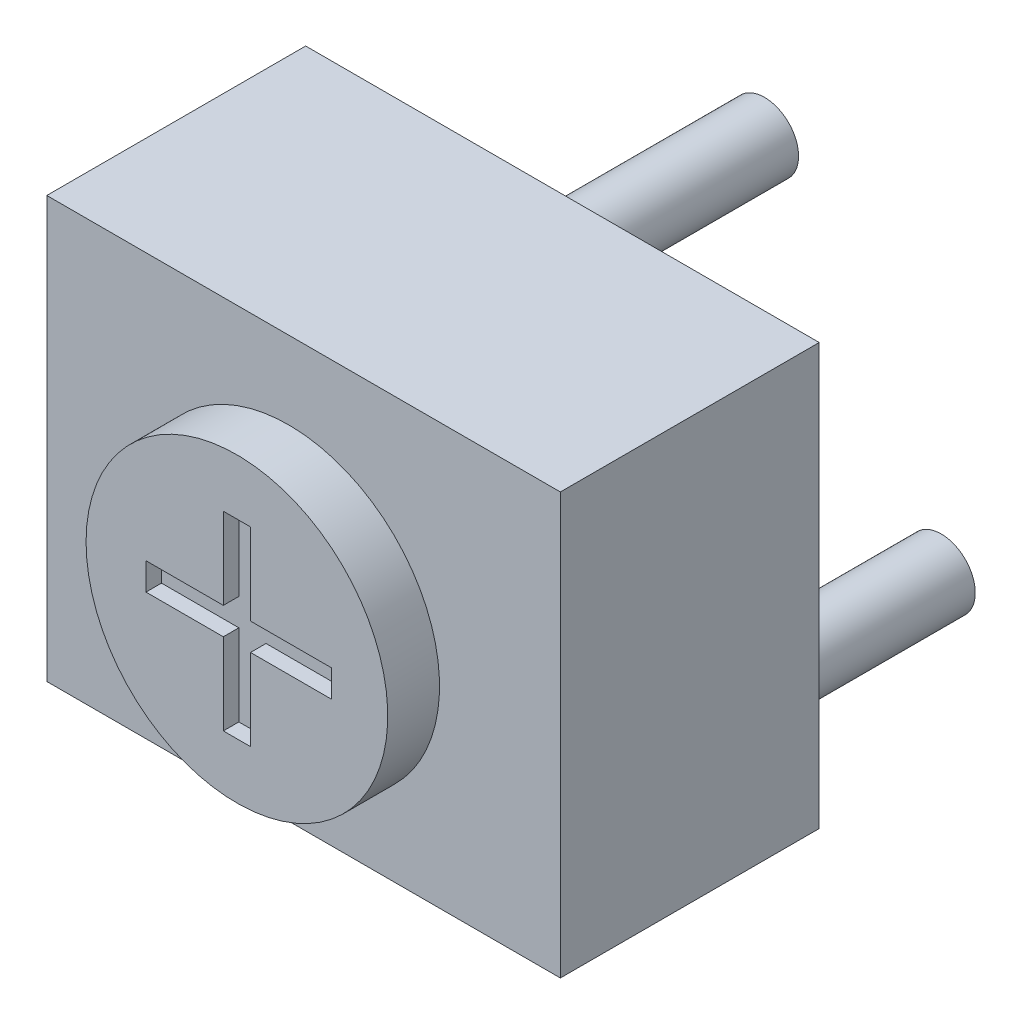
ISO-10303-21;
HEADER;
FILE_DESCRIPTION(('STEP AP214'),'2;1');
FILE_NAME('part.step','',(''),(''),'','','');
FILE_SCHEMA(('AUTOMOTIVE_DESIGN { 1 0 10303 214 1 1 1 1 }'));
ENDSEC;
DATA;
#1=APPLICATION_CONTEXT('core data for automotive mechanical design processes');
#2=APPLICATION_PROTOCOL_DEFINITION('international standard','automotive_design',2000,#1);
#3=PRODUCT_CONTEXT('',#1,'mechanical');
#4=PRODUCT('Part','Part','',(#3));
#5=PRODUCT_RELATED_PRODUCT_CATEGORY('part','',(#4));
#6=PRODUCT_DEFINITION_FORMATION('','',#4);
#7=PRODUCT_DEFINITION_CONTEXT('part definition',#1,'design');
#8=PRODUCT_DEFINITION('design','',#6,#7);
#9=PRODUCT_DEFINITION_SHAPE('','',#8);
#10=(LENGTH_UNIT() NAMED_UNIT(*) SI_UNIT(.MILLI.,.METRE.));
#11=(NAMED_UNIT(*) PLANE_ANGLE_UNIT() SI_UNIT($,.RADIAN.));
#12=(NAMED_UNIT(*) SI_UNIT($,.STERADIAN.) SOLID_ANGLE_UNIT());
#13=UNCERTAINTY_MEASURE_WITH_UNIT(LENGTH_MEASURE(1.E-05),#10,'distance_accuracy_value','');
#14=(GEOMETRIC_REPRESENTATION_CONTEXT(3) GLOBAL_UNCERTAINTY_ASSIGNED_CONTEXT((#13)) GLOBAL_UNIT_ASSIGNED_CONTEXT((#10,
#11,#12)) REPRESENTATION_CONTEXT('',''));
#15=CARTESIAN_POINT('',(0.,0.,0.));
#16=DIRECTION('',(0.,0.,1.));
#17=DIRECTION('',(1.,0.,0.));
#18=AXIS2_PLACEMENT_3D('',#15,#16,#17);
#19=CARTESIAN_POINT('',(40.749645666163,-15.2273275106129,0.));
#20=DIRECTION('',(0.,0.,-1.));
#21=DIRECTION('',(-1.,0.,0.));
#22=AXIS2_PLACEMENT_3D('',#19,#20,#21);
#23=PLANE('',#22);
#24=CARTESIAN_POINT('',(44.6544819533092,-15.8546141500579,0.));
#25=DIRECTION('',(0.,0.,-1.));
#26=DIRECTION('',(-1.,0.,0.));
#27=AXIS2_PLACEMENT_3D('',#24,#25,#26);
#28=CIRCLE('',#27,0.499999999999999);
#29=CARTESIAN_POINT('',(44.1544819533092,-15.8546141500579,0.));
#30=VERTEX_POINT('',#29);
#31=EDGE_CURVE('E256',#30,#30,#28,.F.);
#32=ORIENTED_EDGE('',*,*,#31,.T.);
#33=EDGE_LOOP('',(#32));
#34=FACE_BOUND('',#33,.T.);
#35=DIRECTION('',(0.,-1.,0.));
#36=VECTOR('',#35,1.);
#37=CARTESIAN_POINT('',(40.749645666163,-21.4224598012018,0.));
#38=LINE('',#37,#36);
#39=CARTESIAN_POINT('',(40.749645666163,-15.2273275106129,0.));
#40=VERTEX_POINT('',#39);
#41=CARTESIAN_POINT('',(40.749645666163,-21.4224598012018,0.));
#42=VERTEX_POINT('',#41);
#43=EDGE_CURVE('E271',#40,#42,#38,.T.);
#44=ORIENTED_EDGE('',*,*,#43,.F.);
#45=DIRECTION('',(-1.,0.,0.));
#46=VECTOR('',#45,1.);
#47=CARTESIAN_POINT('',(40.749645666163,-15.2273275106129,0.));
#48=LINE('',#47,#46);
#49=CARTESIAN_POINT('',(48.3081263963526,-15.2273275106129,0.));
#50=VERTEX_POINT('',#49);
#51=EDGE_CURVE('E278',#50,#40,#48,.T.);
#52=ORIENTED_EDGE('',*,*,#51,.F.);
#53=DIRECTION('',(0.,1.,0.));
#54=VECTOR('',#53,1.);
#55=CARTESIAN_POINT('',(48.3081263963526,-21.4224598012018,0.));
#56=LINE('',#55,#54);
#57=CARTESIAN_POINT('',(48.3081263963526,-21.4224598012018,0.));
#58=VERTEX_POINT('',#57);
#59=EDGE_CURVE('E276',#58,#50,#56,.T.);
#60=ORIENTED_EDGE('',*,*,#59,.F.);
#61=DIRECTION('',(1.,0.,0.));
#62=VECTOR('',#61,1.);
#63=CARTESIAN_POINT('',(40.749645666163,-21.4224598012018,0.));
#64=LINE('',#63,#62);
#65=EDGE_CURVE('E274',#42,#58,#64,.T.);
#66=ORIENTED_EDGE('',*,*,#65,.F.);
#67=EDGE_LOOP('',(#44,#52,#60,#66));
#68=FACE_BOUND('',#67,.T.);
#69=CARTESIAN_POINT('',(41.8502779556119,-20.1195169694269,0.));
#70=DIRECTION('',(0.,0.,-1.));
#71=DIRECTION('',(-1.,0.,0.));
#72=AXIS2_PLACEMENT_3D('',#69,#70,#71);
#73=CIRCLE('',#72,0.499999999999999);
#74=CARTESIAN_POINT('',(41.3502779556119,-20.1195169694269,0.));
#75=VERTEX_POINT('',#74);
#76=EDGE_CURVE('E262',#75,#75,#73,.F.);
#77=ORIENTED_EDGE('',*,*,#76,.T.);
#78=EDGE_LOOP('',(#77));
#79=FACE_BOUND('',#78,.T.);
#80=CARTESIAN_POINT('',(47.2545591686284,-20.1195169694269,0.));
#81=DIRECTION('',(0.,0.,-1.));
#82=DIRECTION('',(-1.,0.,0.));
#83=AXIS2_PLACEMENT_3D('',#80,#81,#82);
#84=CIRCLE('',#83,0.499999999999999);
#85=CARTESIAN_POINT('',(46.7545591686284,-20.1195169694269,0.));
#86=VERTEX_POINT('',#85);
#87=EDGE_CURVE('E232',#86,#86,#84,.F.);
#88=ORIENTED_EDGE('',*,*,#87,.T.);
#89=EDGE_LOOP('',(#88));
#90=FACE_BOUND('',#89,.T.);
#91=ADVANCED_FACE('F31',(#34,#68,#79,#90),#23,.T.);
#92=CARTESIAN_POINT('',(40.749645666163,-15.2273275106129,3.81));
#93=DIRECTION('',(0.,0.,-1.));
#94=DIRECTION('',(-1.,0.,0.));
#95=AXIS2_PLACEMENT_3D('',#92,#93,#94);
#96=PLANE('',#95);
#97=DIRECTION('',(0.,-1.,0.));
#98=VECTOR('',#97,1.);
#99=CARTESIAN_POINT('',(40.749645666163,-21.4224598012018,3.81));
#100=LINE('',#99,#98);
#101=CARTESIAN_POINT('',(40.749645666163,-15.2273275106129,3.81));
#102=VERTEX_POINT('',#101);
#103=CARTESIAN_POINT('',(40.749645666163,-21.4224598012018,3.81));
#104=VERTEX_POINT('',#103);
#105=EDGE_CURVE('E280',#102,#104,#100,.T.);
#106=ORIENTED_EDGE('',*,*,#105,.T.);
#107=DIRECTION('',(1.,0.,0.));
#108=VECTOR('',#107,1.);
#109=CARTESIAN_POINT('',(40.749645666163,-21.4224598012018,3.81));
#110=LINE('',#109,#108);
#111=CARTESIAN_POINT('',(48.3081263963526,-21.4224598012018,3.81));
#112=VERTEX_POINT('',#111);
#113=EDGE_CURVE('E282',#104,#112,#110,.T.);
#114=ORIENTED_EDGE('',*,*,#113,.T.);
#115=DIRECTION('',(0.,1.,0.));
#116=VECTOR('',#115,1.);
#117=CARTESIAN_POINT('',(48.3081263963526,-21.4224598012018,3.81));
#118=LINE('',#117,#116);
#119=CARTESIAN_POINT('',(48.3081263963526,-15.2273275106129,3.81));
#120=VERTEX_POINT('',#119);
#121=EDGE_CURVE('E284',#112,#120,#118,.T.);
#122=ORIENTED_EDGE('',*,*,#121,.T.);
#123=DIRECTION('',(-1.,0.,0.));
#124=VECTOR('',#123,1.);
#125=CARTESIAN_POINT('',(40.749645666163,-15.2273275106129,3.81));
#126=LINE('',#125,#124);
#127=EDGE_CURVE('E54',#120,#102,#126,.T.);
#128=ORIENTED_EDGE('',*,*,#127,.T.);
#129=EDGE_LOOP('',(#106,#114,#122,#128));
#130=FACE_BOUND('',#129,.T.);
#131=CARTESIAN_POINT('',(44.3095345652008,-18.5911967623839,3.81));
#132=DIRECTION('',(0.,0.,-1.));
#133=DIRECTION('',(-1.,0.,0.));
#134=AXIS2_PLACEMENT_3D('',#131,#132,#133);
#135=CIRCLE('',#134,2.22008477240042);
#136=CARTESIAN_POINT('',(42.0894497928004,-18.5911967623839,3.81));
#137=VERTEX_POINT('',#136);
#138=EDGE_CURVE('E11',#137,#137,#135,.F.);
#139=ORIENTED_EDGE('',*,*,#138,.F.);
#140=EDGE_LOOP('',(#139));
#141=FACE_BOUND('',#140,.T.);
#142=ADVANCED_FACE('F313',(#130,#141),#96,.F.);
#143=CARTESIAN_POINT('',(40.749645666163,-21.4224598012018,3.81));
#144=DIRECTION('',(1.,0.,0.));
#145=DIRECTION('',(0.,0.,-1.));
#146=AXIS2_PLACEMENT_3D('',#143,#144,#145);
#147=PLANE('',#146);
#148=ORIENTED_EDGE('',*,*,#43,.T.);
#149=DIRECTION('',(0.,0.,-1.));
#150=VECTOR('',#149,1.);
#151=CARTESIAN_POINT('',(40.749645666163,-21.4224598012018,3.81));
#152=LINE('',#151,#150);
#153=EDGE_CURVE('E39',#104,#42,#152,.T.);
#154=ORIENTED_EDGE('',*,*,#153,.F.);
#155=ORIENTED_EDGE('',*,*,#105,.F.);
#156=DIRECTION('',(0.,0.,-1.));
#157=VECTOR('',#156,1.);
#158=CARTESIAN_POINT('',(40.749645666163,-15.2273275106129,3.81));
#159=LINE('',#158,#157);
#160=EDGE_CURVE('E287',#102,#40,#159,.T.);
#161=ORIENTED_EDGE('',*,*,#160,.T.);
#162=EDGE_LOOP('',(#148,#154,#155,#161));
#163=FACE_BOUND('',#162,.T.);
#164=ADVANCED_FACE('F33',(#163),#147,.F.);
#165=CARTESIAN_POINT('',(40.749645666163,-21.4224598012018,3.81));
#166=DIRECTION('',(0.,1.,0.));
#167=DIRECTION('',(0.,0.,1.));
#168=AXIS2_PLACEMENT_3D('',#165,#166,#167);
#169=PLANE('',#168);
#170=ORIENTED_EDGE('',*,*,#65,.T.);
#171=DIRECTION('',(0.,0.,-1.));
#172=VECTOR('',#171,1.);
#173=CARTESIAN_POINT('',(48.3081263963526,-21.4224598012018,3.81));
#174=LINE('',#173,#172);
#175=EDGE_CURVE('E293',#112,#58,#174,.T.);
#176=ORIENTED_EDGE('',*,*,#175,.F.);
#177=ORIENTED_EDGE('',*,*,#113,.F.);
#178=ORIENTED_EDGE('',*,*,#153,.T.);
#179=EDGE_LOOP('',(#170,#176,#177,#178));
#180=FACE_BOUND('',#179,.T.);
#181=ADVANCED_FACE('F298',(#180),#169,.F.);
#182=CARTESIAN_POINT('',(48.3081263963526,-21.4224598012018,3.81));
#183=DIRECTION('',(-1.,0.,0.));
#184=DIRECTION('',(0.,0.,1.));
#185=AXIS2_PLACEMENT_3D('',#182,#183,#184);
#186=PLANE('',#185);
#187=ORIENTED_EDGE('',*,*,#59,.T.);
#188=DIRECTION('',(0.,0.,-1.));
#189=VECTOR('',#188,1.);
#190=CARTESIAN_POINT('',(48.3081263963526,-15.2273275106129,3.81));
#191=LINE('',#190,#189);
#192=EDGE_CURVE('E290',#120,#50,#191,.T.);
#193=ORIENTED_EDGE('',*,*,#192,.F.);
#194=ORIENTED_EDGE('',*,*,#121,.F.);
#195=ORIENTED_EDGE('',*,*,#175,.T.);
#196=EDGE_LOOP('',(#187,#193,#194,#195));
#197=FACE_BOUND('',#196,.T.);
#198=ADVANCED_FACE('F309',(#197),#186,.F.);
#199=CARTESIAN_POINT('',(40.749645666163,-15.2273275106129,3.81));
#200=DIRECTION('',(0.,-1.,0.));
#201=DIRECTION('',(0.,0.,-1.));
#202=AXIS2_PLACEMENT_3D('',#199,#200,#201);
#203=PLANE('',#202);
#204=ORIENTED_EDGE('',*,*,#51,.T.);
#205=ORIENTED_EDGE('',*,*,#160,.F.);
#206=ORIENTED_EDGE('',*,*,#127,.F.);
#207=ORIENTED_EDGE('',*,*,#192,.T.);
#208=EDGE_LOOP('',(#204,#205,#206,#207));
#209=FACE_BOUND('',#208,.T.);
#210=ADVANCED_FACE('F312',(#209),#203,.F.);
#211=CARTESIAN_POINT('',(44.3095345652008,-18.5911967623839,4.572));
#212=DIRECTION('',(0.,0.,-1.));
#213=DIRECTION('',(-1.,0.,0.));
#214=AXIS2_PLACEMENT_3D('',#211,#212,#213);
#215=CYLINDRICAL_SURFACE('',#214,2.22008477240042);
#216=CARTESIAN_POINT('',(44.3095345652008,-18.5911967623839,4.572));
#217=DIRECTION('',(0.,0.,1.));
#218=DIRECTION('',(1.,0.,0.));
#219=AXIS2_PLACEMENT_3D('',#216,#217,#218);
#220=CIRCLE('',#219,2.22008477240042);
#221=CARTESIAN_POINT('',(42.0894497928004,-18.5911967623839,4.572));
#222=VERTEX_POINT('',#221);
#223=EDGE_CURVE('E268',#222,#222,#220,.T.);
#224=CARTESIAN_POINT('',(42.0894497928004,-18.5911967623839,4.572));
#225=CARTESIAN_POINT('',(42.0894497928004,-18.5911967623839,4.5640625));
#226=CARTESIAN_POINT('',(42.0894497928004,-18.5911967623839,4.556125));
#227=CARTESIAN_POINT('',(42.0894497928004,-18.5911967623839,4.54025));
#228=CARTESIAN_POINT('',(42.0894497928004,-18.5911967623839,4.5323125));
#229=CARTESIAN_POINT('',(42.0894497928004,-18.5911967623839,4.5164375));
#230=CARTESIAN_POINT('',(42.0894497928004,-18.5911967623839,4.5085));
#231=CARTESIAN_POINT('',(42.0894497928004,-18.5911967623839,4.492625));
#232=CARTESIAN_POINT('',(42.0894497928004,-18.5911967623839,4.4846875));
#233=CARTESIAN_POINT('',(42.0894497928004,-18.5911967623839,4.4688125));
#234=CARTESIAN_POINT('',(42.0894497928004,-18.5911967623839,4.460875));
#235=CARTESIAN_POINT('',(42.0894497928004,-18.5911967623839,4.445));
#236=CARTESIAN_POINT('',(42.0894497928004,-18.5911967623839,4.4370625));
#237=CARTESIAN_POINT('',(42.0894497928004,-18.5911967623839,4.4211875));
#238=CARTESIAN_POINT('',(42.0894497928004,-18.5911967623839,4.41325));
#239=CARTESIAN_POINT('',(42.0894497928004,-18.5911967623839,4.397375));
#240=CARTESIAN_POINT('',(42.0894497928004,-18.5911967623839,4.3894375));
#241=CARTESIAN_POINT('',(42.0894497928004,-18.5911967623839,4.3735625));
#242=CARTESIAN_POINT('',(42.0894497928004,-18.5911967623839,4.365625));
#243=CARTESIAN_POINT('',(42.0894497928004,-18.5911967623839,4.34975));
#244=CARTESIAN_POINT('',(42.0894497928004,-18.5911967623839,4.3418125));
#245=CARTESIAN_POINT('',(42.0894497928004,-18.5911967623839,4.3259375));
#246=CARTESIAN_POINT('',(42.0894497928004,-18.5911967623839,4.318));
#247=CARTESIAN_POINT('',(42.0894497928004,-18.5911967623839,4.302125));
#248=CARTESIAN_POINT('',(42.0894497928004,-18.5911967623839,4.2941875));
#249=CARTESIAN_POINT('',(42.0894497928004,-18.5911967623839,4.2783125));
#250=CARTESIAN_POINT('',(42.0894497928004,-18.5911967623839,4.270375));
#251=CARTESIAN_POINT('',(42.0894497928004,-18.5911967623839,4.2545));
#252=CARTESIAN_POINT('',(42.0894497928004,-18.5911967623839,4.2465625));
#253=CARTESIAN_POINT('',(42.0894497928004,-18.5911967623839,4.2306875));
#254=CARTESIAN_POINT('',(42.0894497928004,-18.5911967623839,4.22275));
#255=CARTESIAN_POINT('',(42.0894497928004,-18.5911967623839,4.206875));
#256=CARTESIAN_POINT('',(42.0894497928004,-18.5911967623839,4.1989375));
#257=CARTESIAN_POINT('',(42.0894497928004,-18.5911967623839,4.1830625));
#258=CARTESIAN_POINT('',(42.0894497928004,-18.5911967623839,4.175125));
#259=CARTESIAN_POINT('',(42.0894497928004,-18.5911967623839,4.15925));
#260=CARTESIAN_POINT('',(42.0894497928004,-18.5911967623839,4.1513125));
#261=CARTESIAN_POINT('',(42.0894497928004,-18.5911967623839,4.1354375));
#262=CARTESIAN_POINT('',(42.0894497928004,-18.5911967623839,4.1275));
#263=CARTESIAN_POINT('',(42.0894497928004,-18.5911967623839,4.111625));
#264=CARTESIAN_POINT('',(42.0894497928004,-18.5911967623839,4.1036875));
#265=CARTESIAN_POINT('',(42.0894497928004,-18.5911967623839,4.0878125));
#266=CARTESIAN_POINT('',(42.0894497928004,-18.5911967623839,4.079875));
#267=CARTESIAN_POINT('',(42.0894497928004,-18.5911967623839,4.064));
#268=CARTESIAN_POINT('',(42.0894497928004,-18.5911967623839,4.0560625));
#269=CARTESIAN_POINT('',(42.0894497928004,-18.5911967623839,4.0401875));
#270=CARTESIAN_POINT('',(42.0894497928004,-18.5911967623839,4.03225));
#271=CARTESIAN_POINT('',(42.0894497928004,-18.5911967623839,4.016375));
#272=CARTESIAN_POINT('',(42.0894497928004,-18.5911967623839,4.0084375));
#273=CARTESIAN_POINT('',(42.0894497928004,-18.5911967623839,3.9925625));
#274=CARTESIAN_POINT('',(42.0894497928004,-18.5911967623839,3.984625));
#275=CARTESIAN_POINT('',(42.0894497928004,-18.5911967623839,3.96875));
#276=CARTESIAN_POINT('',(42.0894497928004,-18.5911967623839,3.9608125));
#277=CARTESIAN_POINT('',(42.0894497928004,-18.5911967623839,3.9449375));
#278=CARTESIAN_POINT('',(42.0894497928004,-18.5911967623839,3.937));
#279=CARTESIAN_POINT('',(42.0894497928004,-18.5911967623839,3.921125));
#280=CARTESIAN_POINT('',(42.0894497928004,-18.5911967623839,3.9131875));
#281=CARTESIAN_POINT('',(42.0894497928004,-18.5911967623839,3.8973125));
#282=CARTESIAN_POINT('',(42.0894497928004,-18.5911967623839,3.889375));
#283=CARTESIAN_POINT('',(42.0894497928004,-18.5911967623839,3.8735));
#284=CARTESIAN_POINT('',(42.0894497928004,-18.5911967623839,3.8655625));
#285=CARTESIAN_POINT('',(42.0894497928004,-18.5911967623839,3.8496875));
#286=CARTESIAN_POINT('',(42.0894497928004,-18.5911967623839,3.84175));
#287=CARTESIAN_POINT('',(42.0894497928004,-18.5911967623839,3.825875));
#288=CARTESIAN_POINT('',(42.0894497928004,-18.5911967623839,3.8179375));
#289=CARTESIAN_POINT('',(42.0894497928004,-18.5911967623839,3.81));
#290=B_SPLINE_CURVE_WITH_KNOTS('',3,(#224,#225,#226,#227,#228,#229,#230,#231,#232,#233,#234,
#235,#236,#237,#238,#239,#240,#241,#242,#243,#244,#245,#246,#247,#248,#249,#250,#251,#252,#253,
#254,#255,#256,#257,#258,#259,#260,#261,#262,#263,#264,#265,#266,#267,#268,#269,#270,#271,#272,
#273,#274,#275,#276,#277,#278,#279,#280,#281,#282,#283,#284,#285,#286,#287,#288,#289),
.UNSPECIFIED.,.F.,.F.,(4,2,2,2,2,2,2,2,2,2,2,2,2,2,2,2,2,2,2,2,2,2,2,2,2,2,2,2,2,2,2,2,4),(0.,
0.0238125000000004,0.0476250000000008,0.0714375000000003,0.0952500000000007,0.1190625,
0.142875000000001,0.1666875,0.190500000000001,0.2143125,0.238125,0.2619375,0.28575,0.3095625,
0.333375,0.3571875,0.381,0.4048125,0.428625,0.452437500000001,0.47625,0.500062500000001,
0.523875,0.5476875,0.5715,0.5953125,0.619125,0.6429375,0.66675,0.6905625,0.714375,0.7381875,
0.762),.UNSPECIFIED.);
#291=EDGE_CURVE('BSEAM319',#222,#137,#290,.T.);
#292=ORIENTED_EDGE('',*,*,#223,.F.);
#293=ORIENTED_EDGE('',*,*,#138,.T.);
#294=ORIENTED_EDGE('',*,*,#291,.T.);
#295=ORIENTED_EDGE('',*,*,#291,.F.);
#296=EDGE_LOOP('',(#292,#294,#293,#295));
#297=FACE_BOUND('',#296,.T.);
#298=ADVANCED_FACE('F319',(#297),#215,.T.);
#299=CARTESIAN_POINT('',(44.3095345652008,-18.5911967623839,4.572));
#300=DIRECTION('',(0.,0.,1.));
#301=DIRECTION('',(1.,0.,0.));
#302=AXIS2_PLACEMENT_3D('',#299,#300,#301);
#303=PLANE('',#302);
#304=DIRECTION('',(0.,1.,0.));
#305=VECTOR('',#304,1.);
#306=CARTESIAN_POINT('',(44.5095345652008,-18.7911967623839,4.572));
#307=LINE('',#306,#305);
#308=CARTESIAN_POINT('',(44.5095345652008,-19.991444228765,4.572));
#309=VERTEX_POINT('',#308);
#310=CARTESIAN_POINT('',(44.5095345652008,-18.7911967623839,4.572));
#311=VERTEX_POINT('',#310);
#312=EDGE_CURVE('E46',#309,#311,#307,.T.);
#313=ORIENTED_EDGE('',*,*,#312,.F.);
#314=DIRECTION('',(1.,0.,0.));
#315=VECTOR('',#314,1.);
#316=CARTESIAN_POINT('',(44.1095345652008,-19.991444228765,4.572));
#317=LINE('',#316,#315);
#318=CARTESIAN_POINT('',(44.1095345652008,-19.991444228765,4.572));
#319=VERTEX_POINT('',#318);
#320=EDGE_CURVE('E194',#319,#309,#317,.T.);
#321=ORIENTED_EDGE('',*,*,#320,.F.);
#322=DIRECTION('',(0.,-1.,0.));
#323=VECTOR('',#322,1.);
#324=CARTESIAN_POINT('',(44.1095345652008,-18.7911967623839,4.572));
#325=LINE('',#324,#323);
#326=CARTESIAN_POINT('',(44.1095345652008,-18.7911967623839,4.572));
#327=VERTEX_POINT('',#326);
#328=EDGE_CURVE('E191',#327,#319,#325,.T.);
#329=ORIENTED_EDGE('',*,*,#328,.F.);
#330=DIRECTION('',(1.,0.,0.));
#331=VECTOR('',#330,1.);
#332=CARTESIAN_POINT('',(44.1095345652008,-18.7911967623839,4.572));
#333=LINE('',#332,#331);
#334=CARTESIAN_POINT('',(42.9711373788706,-18.7911967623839,4.572));
#335=VERTEX_POINT('',#334);
#336=EDGE_CURVE('E188',#335,#327,#333,.T.);
#337=ORIENTED_EDGE('',*,*,#336,.F.);
#338=DIRECTION('',(0.,-1.,0.));
#339=VECTOR('',#338,1.);
#340=CARTESIAN_POINT('',(42.9711373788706,-18.3911967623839,4.572));
#341=LINE('',#340,#339);
#342=CARTESIAN_POINT('',(42.9711373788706,-18.3911967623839,4.572));
#343=VERTEX_POINT('',#342);
#344=EDGE_CURVE('E185',#343,#335,#341,.T.);
#345=ORIENTED_EDGE('',*,*,#344,.F.);
#346=DIRECTION('',(-1.,0.,0.));
#347=VECTOR('',#346,1.);
#348=CARTESIAN_POINT('',(44.1095345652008,-18.3911967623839,4.572));
#349=LINE('',#348,#347);
#350=CARTESIAN_POINT('',(44.1095345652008,-18.3911967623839,4.572));
#351=VERTEX_POINT('',#350);
#352=EDGE_CURVE('E182',#351,#343,#349,.T.);
#353=ORIENTED_EDGE('',*,*,#352,.F.);
#354=DIRECTION('',(0.,-1.,0.));
#355=VECTOR('',#354,1.);
#356=CARTESIAN_POINT('',(44.1095345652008,-17.1909492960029,4.572));
#357=LINE('',#356,#355);
#358=CARTESIAN_POINT('',(44.1095345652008,-17.1909492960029,4.572));
#359=VERTEX_POINT('',#358);
#360=EDGE_CURVE('E179',#359,#351,#357,.T.);
#361=ORIENTED_EDGE('',*,*,#360,.F.);
#362=DIRECTION('',(-1.,0.,0.));
#363=VECTOR('',#362,1.);
#364=CARTESIAN_POINT('',(44.1095345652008,-17.1909492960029,4.572));
#365=LINE('',#364,#363);
#366=CARTESIAN_POINT('',(44.5095345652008,-17.1909492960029,4.572));
#367=VERTEX_POINT('',#366);
#368=EDGE_CURVE('E176',#367,#359,#365,.T.);
#369=ORIENTED_EDGE('',*,*,#368,.F.);
#370=DIRECTION('',(0.,1.,0.));
#371=VECTOR('',#370,1.);
#372=CARTESIAN_POINT('',(44.5095345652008,-17.1909492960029,4.572));
#373=LINE('',#372,#371);
#374=CARTESIAN_POINT('',(44.5095345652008,-18.3911967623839,4.572));
#375=VERTEX_POINT('',#374);
#376=EDGE_CURVE('E170',#375,#367,#373,.T.);
#377=ORIENTED_EDGE('',*,*,#376,.F.);
#378=DIRECTION('',(-1.,0.,0.));
#379=VECTOR('',#378,1.);
#380=CARTESIAN_POINT('',(44.5095345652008,-18.3911967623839,4.572));
#381=LINE('',#380,#379);
#382=CARTESIAN_POINT('',(45.7003100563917,-18.3911967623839,4.572));
#383=VERTEX_POINT('',#382);
#384=EDGE_CURVE('E168',#383,#375,#381,.T.);
#385=ORIENTED_EDGE('',*,*,#384,.F.);
#386=DIRECTION('',(0.,1.,0.));
#387=VECTOR('',#386,1.);
#388=CARTESIAN_POINT('',(45.7003100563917,-18.3911967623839,4.572));
#389=LINE('',#388,#387);
#390=CARTESIAN_POINT('',(45.7003100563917,-18.7911967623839,4.572));
#391=VERTEX_POINT('',#390);
#392=EDGE_CURVE('E149',#391,#383,#389,.T.);
#393=ORIENTED_EDGE('',*,*,#392,.F.);
#394=DIRECTION('',(1.,0.,0.));
#395=VECTOR('',#394,1.);
#396=CARTESIAN_POINT('',(44.5095345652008,-18.7911967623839,4.572));
#397=LINE('',#396,#395);
#398=EDGE_CURVE('E160',#311,#391,#397,.T.);
#399=ORIENTED_EDGE('',*,*,#398,.F.);
#400=EDGE_LOOP('',(#313,#321,#329,#337,#345,#353,#361,#369,#377,#385,#393,#399));
#401=FACE_BOUND('',#400,.T.);
#402=ORIENTED_EDGE('',*,*,#223,.T.);
#403=EDGE_LOOP('',(#402));
#404=FACE_BOUND('',#403,.T.);
#405=ADVANCED_FACE('F164',(#401,#404),#303,.T.);
#406=CARTESIAN_POINT('',(41.8502779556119,-20.1195169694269,-2.85));
#407=DIRECTION('',(0.,0.,1.));
#408=DIRECTION('',(1.,0.,0.));
#409=AXIS2_PLACEMENT_3D('',#406,#407,#408);
#410=CYLINDRICAL_SURFACE('',#409,0.499999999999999);
#411=CARTESIAN_POINT('',(41.8502779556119,-20.1195169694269,-2.85));
#412=DIRECTION('',(0.,0.,-1.));
#413=DIRECTION('',(-1.,0.,0.));
#414=AXIS2_PLACEMENT_3D('',#411,#412,#413);
#415=CIRCLE('',#414,0.499999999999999);
#416=CARTESIAN_POINT('',(41.3502779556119,-20.1195169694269,-2.85));
#417=VERTEX_POINT('',#416);
#418=EDGE_CURVE('E265',#417,#417,#415,.T.);
#419=ORIENTED_EDGE('',*,*,#418,.F.);
#420=EDGE_LOOP('',(#419));
#421=FACE_BOUND('',#420,.T.);
#422=ORIENTED_EDGE('',*,*,#76,.F.);
#423=EDGE_LOOP('',(#422));
#424=FACE_BOUND('',#423,.T.);
#425=ADVANCED_FACE('F327',(#421,#424),#410,.T.);
#426=CARTESIAN_POINT('',(41.8502779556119,-20.1195169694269,-2.85));
#427=DIRECTION('',(0.,0.,-1.));
#428=DIRECTION('',(-1.,0.,0.));
#429=AXIS2_PLACEMENT_3D('',#426,#427,#428);
#430=PLANE('',#429);
#431=ORIENTED_EDGE('',*,*,#418,.T.);
#432=EDGE_LOOP('',(#431));
#433=FACE_BOUND('',#432,.T.);
#434=ADVANCED_FACE('F375',(#433),#430,.T.);
#435=CARTESIAN_POINT('',(44.6544819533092,-15.8546141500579,-2.85));
#436=DIRECTION('',(0.,0.,1.));
#437=DIRECTION('',(1.,0.,0.));
#438=AXIS2_PLACEMENT_3D('',#435,#436,#437);
#439=CYLINDRICAL_SURFACE('',#438,0.499999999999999);
#440=CARTESIAN_POINT('',(44.6544819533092,-15.8546141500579,-2.85));
#441=DIRECTION('',(0.,0.,-1.));
#442=DIRECTION('',(-1.,0.,0.));
#443=AXIS2_PLACEMENT_3D('',#440,#441,#442);
#444=CIRCLE('',#443,0.499999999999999);
#445=CARTESIAN_POINT('',(44.1544819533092,-15.8546141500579,-2.85));
#446=VERTEX_POINT('',#445);
#447=EDGE_CURVE('E259',#446,#446,#444,.T.);
#448=ORIENTED_EDGE('',*,*,#447,.F.);
#449=EDGE_LOOP('',(#448));
#450=FACE_BOUND('',#449,.T.);
#451=ORIENTED_EDGE('',*,*,#31,.F.);
#452=EDGE_LOOP('',(#451));
#453=FACE_BOUND('',#452,.T.);
#454=ADVANCED_FACE('F383',(#450,#453),#439,.T.);
#455=CARTESIAN_POINT('',(44.6544819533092,-15.8546141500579,-2.85));
#456=DIRECTION('',(0.,0.,-1.));
#457=DIRECTION('',(-1.,0.,0.));
#458=AXIS2_PLACEMENT_3D('',#455,#456,#457);
#459=PLANE('',#458);
#460=ORIENTED_EDGE('',*,*,#447,.T.);
#461=EDGE_LOOP('',(#460));
#462=FACE_BOUND('',#461,.T.);
#463=ADVANCED_FACE('F391',(#462),#459,.T.);
#464=CARTESIAN_POINT('',(47.2545591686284,-20.1195169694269,-2.85));
#465=DIRECTION('',(0.,0.,1.));
#466=DIRECTION('',(1.,0.,0.));
#467=AXIS2_PLACEMENT_3D('',#464,#465,#466);
#468=CYLINDRICAL_SURFACE('',#467,0.499999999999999);
#469=CARTESIAN_POINT('',(47.2545591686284,-20.1195169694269,-2.85));
#470=DIRECTION('',(0.,0.,-1.));
#471=DIRECTION('',(-1.,0.,0.));
#472=AXIS2_PLACEMENT_3D('',#469,#470,#471);
#473=CIRCLE('',#472,0.499999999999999);
#474=CARTESIAN_POINT('',(46.7545591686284,-20.1195169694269,-2.85));
#475=VERTEX_POINT('',#474);
#476=EDGE_CURVE('E253',#475,#475,#473,.T.);
#477=ORIENTED_EDGE('',*,*,#476,.F.);
#478=EDGE_LOOP('',(#477));
#479=FACE_BOUND('',#478,.T.);
#480=ORIENTED_EDGE('',*,*,#87,.F.);
#481=EDGE_LOOP('',(#480));
#482=FACE_BOUND('',#481,.T.);
#483=ADVANCED_FACE('F399',(#479,#482),#468,.T.);
#484=CARTESIAN_POINT('',(47.2545591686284,-20.1195169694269,-2.85));
#485=DIRECTION('',(0.,0.,-1.));
#486=DIRECTION('',(-1.,0.,0.));
#487=AXIS2_PLACEMENT_3D('',#484,#485,#486);
#488=PLANE('',#487);
#489=ORIENTED_EDGE('',*,*,#476,.T.);
#490=EDGE_LOOP('',(#489));
#491=FACE_BOUND('',#490,.T.);
#492=ADVANCED_FACE('F407',(#491),#488,.T.);
#493=CARTESIAN_POINT('',(44.5095345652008,-18.7911967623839,4.3434));
#494=DIRECTION('',(1.,0.,0.));
#495=DIRECTION('',(0.,0.,-1.));
#496=AXIS2_PLACEMENT_3D('',#493,#494,#495);
#497=PLANE('',#496);
#498=ORIENTED_EDGE('',*,*,#312,.T.);
#499=DIRECTION('',(0.,0.,1.));
#500=VECTOR('',#499,1.);
#501=CARTESIAN_POINT('',(44.5095345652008,-18.7911967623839,4.3434));
#502=LINE('',#501,#500);
#503=CARTESIAN_POINT('',(44.5095345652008,-18.7911967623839,4.3434));
#504=VERTEX_POINT('',#503);
#505=EDGE_CURVE('E157',#504,#311,#502,.T.);
#506=ORIENTED_EDGE('',*,*,#505,.F.);
#507=DIRECTION('',(0.,1.,0.));
#508=VECTOR('',#507,1.);
#509=CARTESIAN_POINT('',(44.5095345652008,-18.7911967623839,4.3434));
#510=LINE('',#509,#508);
#511=CARTESIAN_POINT('',(44.5095345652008,-19.991444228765,4.3434));
#512=VERTEX_POINT('',#511);
#513=EDGE_CURVE('E197',#512,#504,#510,.T.);
#514=ORIENTED_EDGE('',*,*,#513,.F.);
#515=DIRECTION('',(0.,0.,1.));
#516=VECTOR('',#515,1.);
#517=CARTESIAN_POINT('',(44.5095345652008,-19.991444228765,4.3434));
#518=LINE('',#517,#516);
#519=EDGE_CURVE('E230',#512,#309,#518,.T.);
#520=ORIENTED_EDGE('',*,*,#519,.T.);
#521=EDGE_LOOP('',(#498,#506,#514,#520));
#522=FACE_BOUND('',#521,.T.);
#523=ADVANCED_FACE('F414',(#522),#497,.F.);
#524=CARTESIAN_POINT('',(44.1095345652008,-19.991444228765,4.3434));
#525=DIRECTION('',(0.,-1.,0.));
#526=DIRECTION('',(0.,0.,-1.));
#527=AXIS2_PLACEMENT_3D('',#524,#525,#526);
#528=PLANE('',#527);
#529=ORIENTED_EDGE('',*,*,#320,.T.);
#530=ORIENTED_EDGE('',*,*,#519,.F.);
#531=DIRECTION('',(1.,0.,0.));
#532=VECTOR('',#531,1.);
#533=CARTESIAN_POINT('',(44.1095345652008,-19.991444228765,4.3434));
#534=LINE('',#533,#532);
#535=CARTESIAN_POINT('',(44.1095345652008,-19.991444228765,4.3434));
#536=VERTEX_POINT('',#535);
#537=EDGE_CURVE('E227',#536,#512,#534,.T.);
#538=ORIENTED_EDGE('',*,*,#537,.F.);
#539=DIRECTION('',(0.,0.,1.));
#540=VECTOR('',#539,1.);
#541=CARTESIAN_POINT('',(44.1095345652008,-19.991444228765,4.3434));
#542=LINE('',#541,#540);
#543=EDGE_CURVE('E233',#536,#319,#542,.T.);
#544=ORIENTED_EDGE('',*,*,#543,.T.);
#545=EDGE_LOOP('',(#529,#530,#538,#544));
#546=FACE_BOUND('',#545,.T.);
#547=ADVANCED_FACE('F421',(#546),#528,.F.);
#548=CARTESIAN_POINT('',(44.1095345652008,-18.7911967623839,4.3434));
#549=DIRECTION('',(-1.,0.,0.));
#550=DIRECTION('',(0.,0.,1.));
#551=AXIS2_PLACEMENT_3D('',#548,#549,#550);
#552=PLANE('',#551);
#553=ORIENTED_EDGE('',*,*,#328,.T.);
#554=ORIENTED_EDGE('',*,*,#543,.F.);
#555=DIRECTION('',(0.,-1.,0.));
#556=VECTOR('',#555,1.);
#557=CARTESIAN_POINT('',(44.1095345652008,-18.7911967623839,4.3434));
#558=LINE('',#557,#556);
#559=CARTESIAN_POINT('',(44.1095345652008,-18.7911967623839,4.3434));
#560=VERTEX_POINT('',#559);
#561=EDGE_CURVE('E224',#560,#536,#558,.T.);
#562=ORIENTED_EDGE('',*,*,#561,.F.);
#563=DIRECTION('',(0.,0.,1.));
#564=VECTOR('',#563,1.);
#565=CARTESIAN_POINT('',(44.1095345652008,-18.7911967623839,4.3434));
#566=LINE('',#565,#564);
#567=EDGE_CURVE('E235',#560,#327,#566,.T.);
#568=ORIENTED_EDGE('',*,*,#567,.T.);
#569=EDGE_LOOP('',(#553,#554,#562,#568));
#570=FACE_BOUND('',#569,.T.);
#571=ADVANCED_FACE('F428',(#570),#552,.F.);
#572=CARTESIAN_POINT('',(44.1095345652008,-18.7911967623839,4.3434));
#573=DIRECTION('',(0.,-1.,0.));
#574=DIRECTION('',(0.,0.,-1.));
#575=AXIS2_PLACEMENT_3D('',#572,#573,#574);
#576=PLANE('',#575);
#577=ORIENTED_EDGE('',*,*,#336,.T.);
#578=ORIENTED_EDGE('',*,*,#567,.F.);
#579=DIRECTION('',(1.,0.,0.));
#580=VECTOR('',#579,1.);
#581=CARTESIAN_POINT('',(44.1095345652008,-18.7911967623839,4.3434));
#582=LINE('',#581,#580);
#583=CARTESIAN_POINT('',(42.9711373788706,-18.7911967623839,4.3434));
#584=VERTEX_POINT('',#583);
#585=EDGE_CURVE('E221',#584,#560,#582,.T.);
#586=ORIENTED_EDGE('',*,*,#585,.F.);
#587=DIRECTION('',(0.,0.,1.));
#588=VECTOR('',#587,1.);
#589=CARTESIAN_POINT('',(42.9711373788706,-18.7911967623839,4.3434));
#590=LINE('',#589,#588);
#591=EDGE_CURVE('E237',#584,#335,#590,.T.);
#592=ORIENTED_EDGE('',*,*,#591,.T.);
#593=EDGE_LOOP('',(#577,#578,#586,#592));
#594=FACE_BOUND('',#593,.T.);
#595=ADVANCED_FACE('F436',(#594),#576,.F.);
#596=CARTESIAN_POINT('',(42.9711373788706,-18.3911967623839,4.3434));
#597=DIRECTION('',(-1.,0.,0.));
#598=DIRECTION('',(0.,0.,1.));
#599=AXIS2_PLACEMENT_3D('',#596,#597,#598);
#600=PLANE('',#599);
#601=ORIENTED_EDGE('',*,*,#344,.T.);
#602=ORIENTED_EDGE('',*,*,#591,.F.);
#603=DIRECTION('',(0.,-1.,0.));
#604=VECTOR('',#603,1.);
#605=CARTESIAN_POINT('',(42.9711373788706,-18.3911967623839,4.3434));
#606=LINE('',#605,#604);
#607=CARTESIAN_POINT('',(42.9711373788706,-18.3911967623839,4.3434));
#608=VERTEX_POINT('',#607);
#609=EDGE_CURVE('E218',#608,#584,#606,.T.);
#610=ORIENTED_EDGE('',*,*,#609,.F.);
#611=DIRECTION('',(0.,0.,1.));
#612=VECTOR('',#611,1.);
#613=CARTESIAN_POINT('',(42.9711373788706,-18.3911967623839,4.3434));
#614=LINE('',#613,#612);
#615=EDGE_CURVE('E239',#608,#343,#614,.T.);
#616=ORIENTED_EDGE('',*,*,#615,.T.);
#617=EDGE_LOOP('',(#601,#602,#610,#616));
#618=FACE_BOUND('',#617,.T.);
#619=ADVANCED_FACE('F444',(#618),#600,.F.);
#620=CARTESIAN_POINT('',(44.1095345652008,-18.3911967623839,4.3434));
#621=DIRECTION('',(0.,1.,0.));
#622=DIRECTION('',(0.,0.,1.));
#623=AXIS2_PLACEMENT_3D('',#620,#621,#622);
#624=PLANE('',#623);
#625=ORIENTED_EDGE('',*,*,#352,.T.);
#626=ORIENTED_EDGE('',*,*,#615,.F.);
#627=DIRECTION('',(-1.,0.,0.));
#628=VECTOR('',#627,1.);
#629=CARTESIAN_POINT('',(44.1095345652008,-18.3911967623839,4.3434));
#630=LINE('',#629,#628);
#631=CARTESIAN_POINT('',(44.1095345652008,-18.3911967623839,4.3434));
#632=VERTEX_POINT('',#631);
#633=EDGE_CURVE('E215',#632,#608,#630,.T.);
#634=ORIENTED_EDGE('',*,*,#633,.F.);
#635=DIRECTION('',(0.,0.,1.));
#636=VECTOR('',#635,1.);
#637=CARTESIAN_POINT('',(44.1095345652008,-18.3911967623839,4.3434));
#638=LINE('',#637,#636);
#639=EDGE_CURVE('E241',#632,#351,#638,.T.);
#640=ORIENTED_EDGE('',*,*,#639,.T.);
#641=EDGE_LOOP('',(#625,#626,#634,#640));
#642=FACE_BOUND('',#641,.T.);
#643=ADVANCED_FACE('F452',(#642),#624,.F.);
#644=CARTESIAN_POINT('',(44.1095345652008,-17.1909492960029,4.3434));
#645=DIRECTION('',(-1.,0.,0.));
#646=DIRECTION('',(0.,0.,1.));
#647=AXIS2_PLACEMENT_3D('',#644,#645,#646);
#648=PLANE('',#647);
#649=ORIENTED_EDGE('',*,*,#360,.T.);
#650=ORIENTED_EDGE('',*,*,#639,.F.);
#651=DIRECTION('',(0.,-1.,0.));
#652=VECTOR('',#651,1.);
#653=CARTESIAN_POINT('',(44.1095345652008,-17.1909492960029,4.3434));
#654=LINE('',#653,#652);
#655=CARTESIAN_POINT('',(44.1095345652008,-17.1909492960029,4.3434));
#656=VERTEX_POINT('',#655);
#657=EDGE_CURVE('E212',#656,#632,#654,.T.);
#658=ORIENTED_EDGE('',*,*,#657,.F.);
#659=DIRECTION('',(0.,0.,1.));
#660=VECTOR('',#659,1.);
#661=CARTESIAN_POINT('',(44.1095345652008,-17.1909492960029,4.3434));
#662=LINE('',#661,#660);
#663=EDGE_CURVE('E243',#656,#359,#662,.T.);
#664=ORIENTED_EDGE('',*,*,#663,.T.);
#665=EDGE_LOOP('',(#649,#650,#658,#664));
#666=FACE_BOUND('',#665,.T.);
#667=ADVANCED_FACE('F460',(#666),#648,.F.);
#668=CARTESIAN_POINT('',(44.1095345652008,-17.1909492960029,4.3434));
#669=DIRECTION('',(0.,1.,0.));
#670=DIRECTION('',(0.,0.,1.));
#671=AXIS2_PLACEMENT_3D('',#668,#669,#670);
#672=PLANE('',#671);
#673=ORIENTED_EDGE('',*,*,#368,.T.);
#674=ORIENTED_EDGE('',*,*,#663,.F.);
#675=DIRECTION('',(-1.,0.,0.));
#676=VECTOR('',#675,1.);
#677=CARTESIAN_POINT('',(44.1095345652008,-17.1909492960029,4.3434));
#678=LINE('',#677,#676);
#679=CARTESIAN_POINT('',(44.5095345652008,-17.1909492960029,4.3434));
#680=VERTEX_POINT('',#679);
#681=EDGE_CURVE('E209',#680,#656,#678,.T.);
#682=ORIENTED_EDGE('',*,*,#681,.F.);
#683=DIRECTION('',(0.,0.,1.));
#684=VECTOR('',#683,1.);
#685=CARTESIAN_POINT('',(44.5095345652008,-17.1909492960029,4.3434));
#686=LINE('',#685,#684);
#687=EDGE_CURVE('E245',#680,#367,#686,.T.);
#688=ORIENTED_EDGE('',*,*,#687,.T.);
#689=EDGE_LOOP('',(#673,#674,#682,#688));
#690=FACE_BOUND('',#689,.T.);
#691=ADVANCED_FACE('F468',(#690),#672,.F.);
#692=CARTESIAN_POINT('',(44.5095345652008,-17.1909492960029,4.3434));
#693=DIRECTION('',(1.,0.,0.));
#694=DIRECTION('',(0.,0.,-1.));
#695=AXIS2_PLACEMENT_3D('',#692,#693,#694);
#696=PLANE('',#695);
#697=ORIENTED_EDGE('',*,*,#376,.T.);
#698=ORIENTED_EDGE('',*,*,#687,.F.);
#699=DIRECTION('',(0.,1.,0.));
#700=VECTOR('',#699,1.);
#701=CARTESIAN_POINT('',(44.5095345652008,-17.1909492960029,4.3434));
#702=LINE('',#701,#700);
#703=CARTESIAN_POINT('',(44.5095345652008,-18.3911967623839,4.3434));
#704=VERTEX_POINT('',#703);
#705=EDGE_CURVE('E206',#704,#680,#702,.T.);
#706=ORIENTED_EDGE('',*,*,#705,.F.);
#707=DIRECTION('',(0.,0.,1.));
#708=VECTOR('',#707,1.);
#709=CARTESIAN_POINT('',(44.5095345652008,-18.3911967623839,4.3434));
#710=LINE('',#709,#708);
#711=EDGE_CURVE('E247',#704,#375,#710,.T.);
#712=ORIENTED_EDGE('',*,*,#711,.T.);
#713=EDGE_LOOP('',(#697,#698,#706,#712));
#714=FACE_BOUND('',#713,.T.);
#715=ADVANCED_FACE('F476',(#714),#696,.F.);
#716=CARTESIAN_POINT('',(44.5095345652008,-18.3911967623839,4.3434));
#717=DIRECTION('',(0.,1.,0.));
#718=DIRECTION('',(0.,0.,1.));
#719=AXIS2_PLACEMENT_3D('',#716,#717,#718);
#720=PLANE('',#719);
#721=ORIENTED_EDGE('',*,*,#384,.T.);
#722=ORIENTED_EDGE('',*,*,#711,.F.);
#723=DIRECTION('',(-1.,0.,0.));
#724=VECTOR('',#723,1.);
#725=CARTESIAN_POINT('',(44.5095345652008,-18.3911967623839,4.3434));
#726=LINE('',#725,#724);
#727=CARTESIAN_POINT('',(45.7003100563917,-18.3911967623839,4.3434));
#728=VERTEX_POINT('',#727);
#729=EDGE_CURVE('E203',#728,#704,#726,.T.);
#730=ORIENTED_EDGE('',*,*,#729,.F.);
#731=DIRECTION('',(0.,0.,1.));
#732=VECTOR('',#731,1.);
#733=CARTESIAN_POINT('',(45.7003100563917,-18.3911967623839,4.3434));
#734=LINE('',#733,#732);
#735=EDGE_CURVE('E156',#728,#383,#734,.T.);
#736=ORIENTED_EDGE('',*,*,#735,.T.);
#737=EDGE_LOOP('',(#721,#722,#730,#736));
#738=FACE_BOUND('',#737,.T.);
#739=ADVANCED_FACE('F484',(#738),#720,.F.);
#740=CARTESIAN_POINT('',(45.7003100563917,-18.3911967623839,4.3434));
#741=DIRECTION('',(1.,0.,0.));
#742=DIRECTION('',(0.,0.,-1.));
#743=AXIS2_PLACEMENT_3D('',#740,#741,#742);
#744=PLANE('',#743);
#745=ORIENTED_EDGE('',*,*,#392,.T.);
#746=ORIENTED_EDGE('',*,*,#735,.F.);
#747=DIRECTION('',(0.,1.,0.));
#748=VECTOR('',#747,1.);
#749=CARTESIAN_POINT('',(45.7003100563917,-18.3911967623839,4.3434));
#750=LINE('',#749,#748);
#751=CARTESIAN_POINT('',(45.7003100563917,-18.7911967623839,4.3434));
#752=VERTEX_POINT('',#751);
#753=EDGE_CURVE('E152',#752,#728,#750,.T.);
#754=ORIENTED_EDGE('',*,*,#753,.F.);
#755=DIRECTION('',(0.,0.,1.));
#756=VECTOR('',#755,1.);
#757=CARTESIAN_POINT('',(45.7003100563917,-18.7911967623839,4.3434));
#758=LINE('',#757,#756);
#759=EDGE_CURVE('E145',#752,#391,#758,.T.);
#760=ORIENTED_EDGE('',*,*,#759,.T.);
#761=EDGE_LOOP('',(#745,#746,#754,#760));
#762=FACE_BOUND('',#761,.T.);
#763=ADVANCED_FACE('F147',(#762),#744,.F.);
#764=CARTESIAN_POINT('',(44.5095345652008,-18.7911967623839,4.3434));
#765=DIRECTION('',(0.,-1.,0.));
#766=DIRECTION('',(0.,0.,-1.));
#767=AXIS2_PLACEMENT_3D('',#764,#765,#766);
#768=PLANE('',#767);
#769=ORIENTED_EDGE('',*,*,#398,.T.);
#770=ORIENTED_EDGE('',*,*,#759,.F.);
#771=DIRECTION('',(1.,0.,0.));
#772=VECTOR('',#771,1.);
#773=CARTESIAN_POINT('',(44.5095345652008,-18.7911967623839,4.3434));
#774=LINE('',#773,#772);
#775=EDGE_CURVE('E200',#504,#752,#774,.T.);
#776=ORIENTED_EDGE('',*,*,#775,.F.);
#777=ORIENTED_EDGE('',*,*,#505,.T.);
#778=EDGE_LOOP('',(#769,#770,#776,#777));
#779=FACE_BOUND('',#778,.T.);
#780=ADVANCED_FACE('F161',(#779),#768,.F.);
#781=CARTESIAN_POINT('',(44.5095345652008,-19.991444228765,4.3434));
#782=DIRECTION('',(0.,0.,1.));
#783=DIRECTION('',(1.,0.,0.));
#784=AXIS2_PLACEMENT_3D('',#781,#782,#783);
#785=PLANE('',#784);
#786=ORIENTED_EDGE('',*,*,#513,.T.);
#787=ORIENTED_EDGE('',*,*,#775,.T.);
#788=ORIENTED_EDGE('',*,*,#753,.T.);
#789=ORIENTED_EDGE('',*,*,#729,.T.);
#790=ORIENTED_EDGE('',*,*,#705,.T.);
#791=ORIENTED_EDGE('',*,*,#681,.T.);
#792=ORIENTED_EDGE('',*,*,#657,.T.);
#793=ORIENTED_EDGE('',*,*,#633,.T.);
#794=ORIENTED_EDGE('',*,*,#609,.T.);
#795=ORIENTED_EDGE('',*,*,#585,.T.);
#796=ORIENTED_EDGE('',*,*,#561,.T.);
#797=ORIENTED_EDGE('',*,*,#537,.T.);
#798=EDGE_LOOP('',(#786,#787,#788,#789,#790,#791,#792,#793,#794,#795,#796,#797));
#799=FACE_BOUND('',#798,.T.);
#800=ADVANCED_FACE('F505',(#799),#785,.T.);
#801=CLOSED_SHELL('',(#91,#142,#164,#181,#198,#210,#298,#405,#425,#434,#454,#463,#483,#492,#523,
#547,#571,#595,#619,#643,#667,#691,#715,#739,#763,#780,#800));
#802=MANIFOLD_SOLID_BREP('B2',#801);
#803=ADVANCED_BREP_SHAPE_REPRESENTATION('',(#18,#802),#14);
#804=SHAPE_DEFINITION_REPRESENTATION(#9,#803);
ENDSEC;
END-ISO-10303-21;
